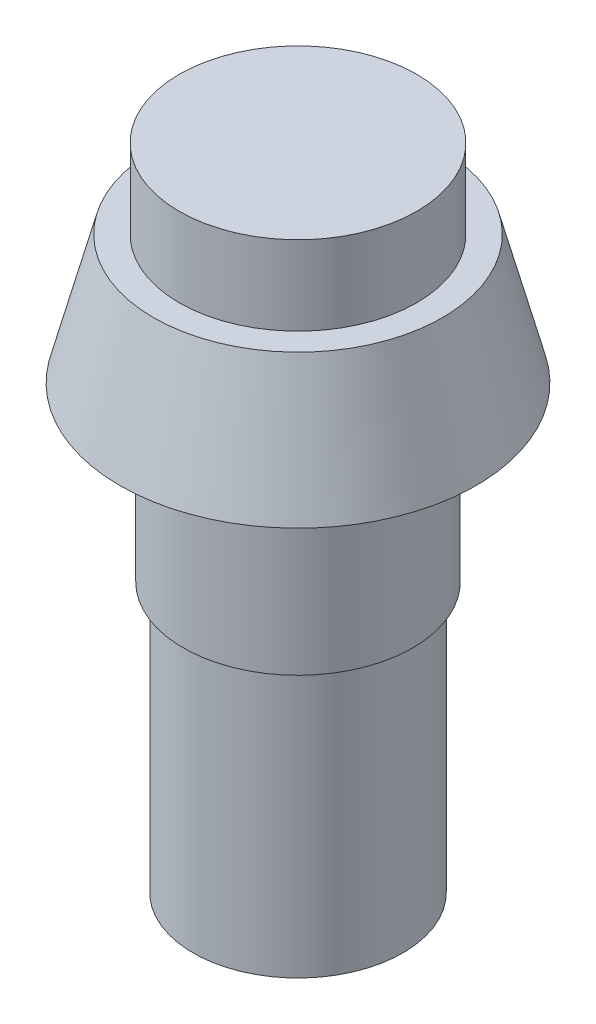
from build123d import *

# Parameters (mm, degrees)
SKETCH1_W = 5.3
SKETCH1_H = 13.6


with BuildPart() as part:
    # Sketch1 → Revolve1 (revolve)
    with BuildSketch(Plane.XY, mode=Mode.PRIVATE) as revolve1_sk:
        Polygon((5.8, 0), (0, 0), (0, -8.7), (5.3, -8.7), (5.8, -8.7), align=None)
        with Locations((2.65, -15.5)):
            Rectangle(SKETCH1_W, SKETCH1_H)
        Polygon((9, 0), (0, 0), (0, 10.5), (6, 10.5), (6, 6.5), (7.3, 6.5), align=None)
    revolve(revolve1_sk.sketch.rotate(Axis((0, 0, 0), (0, 1, 0)), 90), axis=Axis((0, 0, 0), (0, 1, 0)))


solid = part.part
